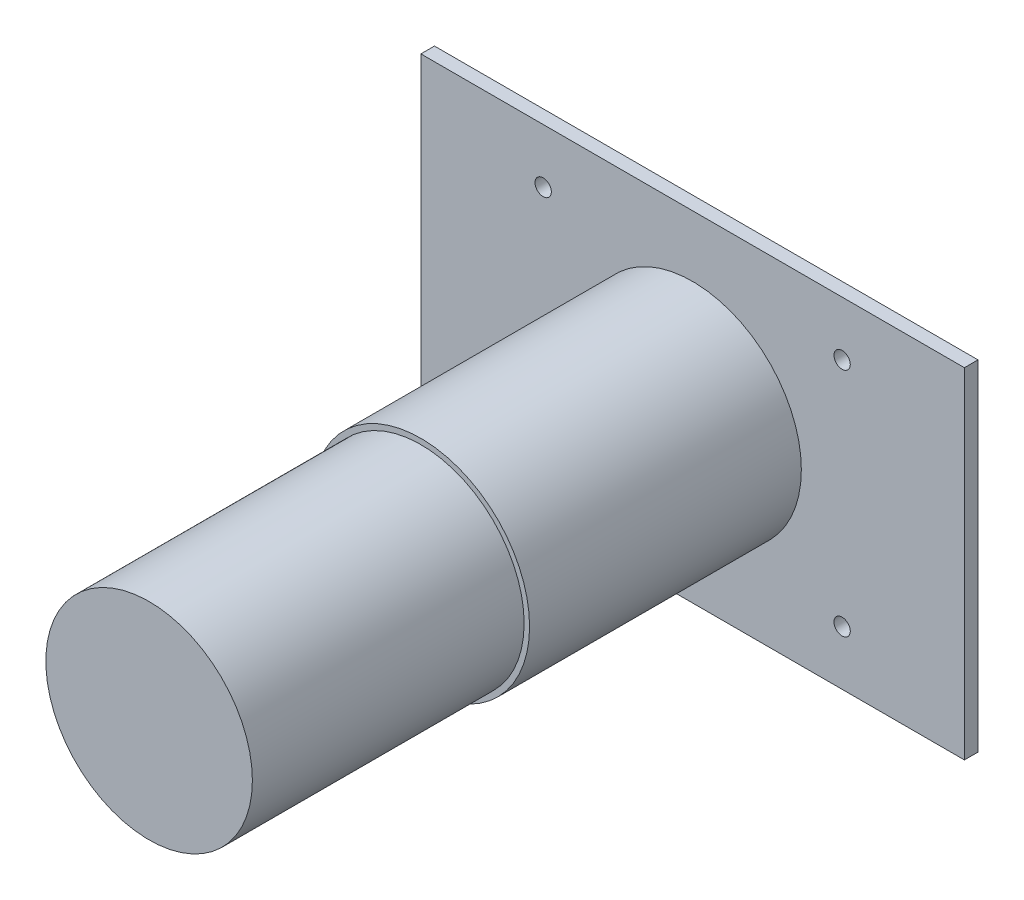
from build123d import *

# Parameters (mm, degrees)
ESQUISSE1_W               = 200
ESQUISSE1_H               = 125
BOSS_EXTRU_1_DEPTH        = 5
ESQUISSE2_R               = 40
ESQUISSE2_R_2             = 36
BOSS_EXTRU_2_DEPTH        = 200
ENL_V_START               = -100
ESQUISSE3_R               = 40
ESQUISSE3_R_2             = 38
ENL_V_MAT_EXTRU_1_DEPTH   = 100
BOSS_EXTRU_3_START        = -5
ESQUISSE4_R               = 36
BOSS_EXTRU_3_DEPTH        = 5
ESQUISSE5_R               = 3
ENL_V_MAT_EXTRU_2_DEPTH   = 5
SYM_TRIE2_COPY_1_SKETCH_R = 3
SYM_TRIE2_COPY_1_DEPTH    = 5


with BuildPart() as part:
    # Esquisse1 → Boss.-Extru.1 (new body)
    with BuildSketch(Plane.XY):
        with Locations((-2.640512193, -5.781938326)):
            Rectangle(ESQUISSE1_W, ESQUISSE1_H)
    extrude(amount=BOSS_EXTRU_1_DEPTH)

    # Esquisse2 → Boss.-Extru.2 (add)
    with BuildSketch(Plane.XY.offset(5)):
        with Locations((-2.640512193, -5.781938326)):
            Circle(ESQUISSE2_R)
        with Locations((-2.640512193, -5.781938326)):
            Circle(ESQUISSE2_R_2, mode=Mode.SUBTRACT)
    extrude(amount=BOSS_EXTRU_2_DEPTH)

    # Esquisse3 → Enl_v. mat.-Extru.1 (cut)
    with BuildSketch(Plane.XY.offset(205).offset(ENL_V_START)):
        with Locations((-2.640512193, -5.781938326)):
            Circle(ESQUISSE3_R)
        with Locations((-2.640512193, -5.781938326)):
            Circle(ESQUISSE3_R_2, mode=Mode.SUBTRACT)
    extrude(amount=ENL_V_MAT_EXTRU_1_DEPTH, mode=Mode.SUBTRACT)

    # Esquisse4 → Boss.-Extru.3 (add)
    with BuildSketch(Plane.XY.offset(205).offset(BOSS_EXTRU_3_START)):
        with Locations((-2.640512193, -5.781938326)):
            Circle(ESQUISSE4_R)
    extrude(amount=BOSS_EXTRU_3_DEPTH)

    # Esquisse5 → Enl_v. mat.-Extru.2 (cut)
    with BuildSketch(Plane.XY.offset(5)):
        with Locations((-57.640512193, -48.281938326)):
            Circle(ESQUISSE5_R)
    enl_v_mat_extru_2 = extrude(amount=-ENL_V_MAT_EXTRU_2_DEPTH, mode=Mode.SUBTRACT)

    # Sym_trie1: Enl_v. mat.-Extru.2 across plane
    add(enl_v_mat_extru_2.mirror(Plane(origin=(0, -5.781938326, 0), x_dir=(0, 0, 1), z_dir=(0, -1, 0))), mode=Mode.SUBTRACT)

    # Sym_trie2: Enl_v. mat.-Extru.2 across plane
    add(enl_v_mat_extru_2.mirror(Plane(origin=(-2.640512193, 0, 0), x_dir=(0, 0, 1), z_dir=(1, 0, 0))), mode=Mode.SUBTRACT)

    # Sym_trie2 copy 1 sketch → Sym_trie2 copy 1 (cut)
    with BuildSketch(Plane(origin=(-5.281024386, -11.563876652, 5), x_dir=(-1, 0, 0), z_dir=(0, 0, 1))):
        with Locations((-57.640512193, -48.281938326)):
            Circle(SYM_TRIE2_COPY_1_SKETCH_R)
    extrude(amount=-SYM_TRIE2_COPY_1_DEPTH, mode=Mode.SUBTRACT)


solid = part.part
